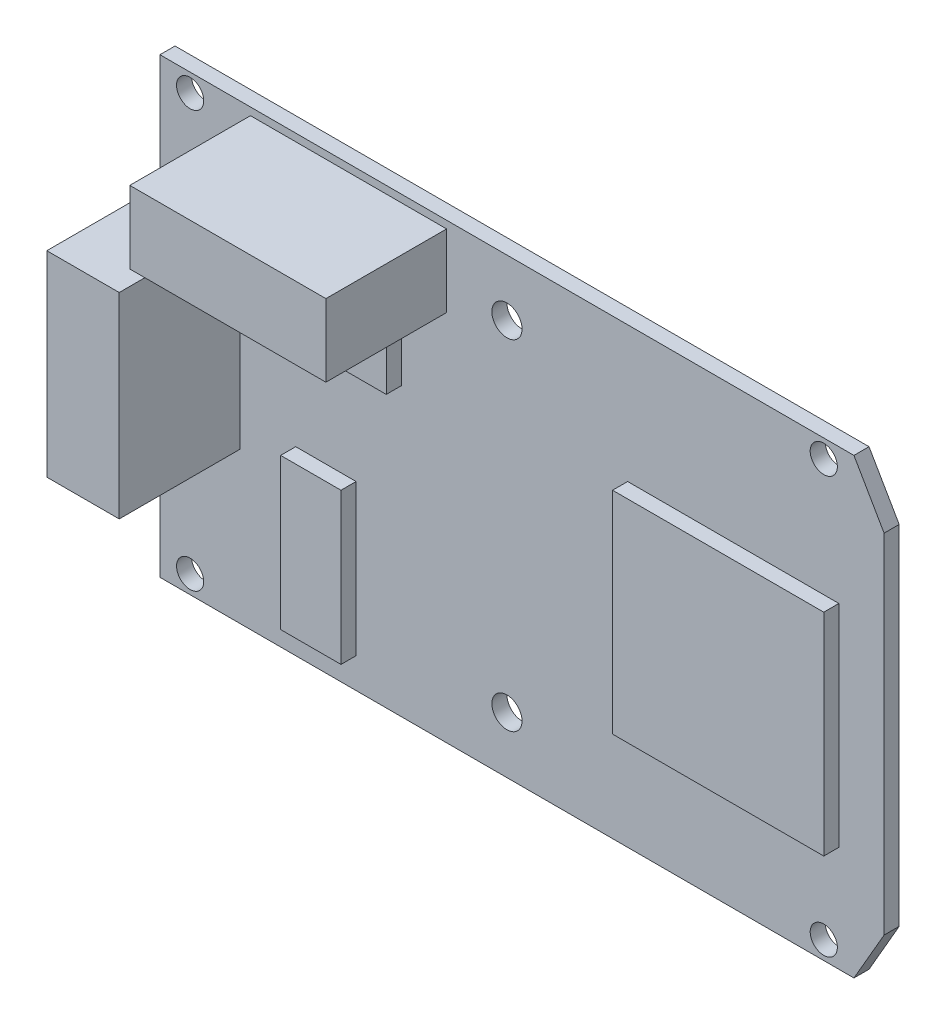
ISO-10303-21;
HEADER;
FILE_DESCRIPTION(('STEP AP214'),'2;1');
FILE_NAME('part.step','',(''),(''),'','','');
FILE_SCHEMA(('AUTOMOTIVE_DESIGN { 1 0 10303 214 1 1 1 1 }'));
ENDSEC;
DATA;
#1=APPLICATION_CONTEXT('core data for automotive mechanical design processes');
#2=APPLICATION_PROTOCOL_DEFINITION('international standard','automotive_design',2000,#1);
#3=PRODUCT_CONTEXT('',#1,'mechanical');
#4=PRODUCT('Part','Part','',(#3));
#5=PRODUCT_RELATED_PRODUCT_CATEGORY('part','',(#4));
#6=PRODUCT_DEFINITION_FORMATION('','',#4);
#7=PRODUCT_DEFINITION_CONTEXT('part definition',#1,'design');
#8=PRODUCT_DEFINITION('design','',#6,#7);
#9=PRODUCT_DEFINITION_SHAPE('','',#8);
#10=(LENGTH_UNIT() NAMED_UNIT(*) SI_UNIT(.MILLI.,.METRE.));
#11=(NAMED_UNIT(*) PLANE_ANGLE_UNIT() SI_UNIT($,.RADIAN.));
#12=(NAMED_UNIT(*) SI_UNIT($,.STERADIAN.) SOLID_ANGLE_UNIT());
#13=UNCERTAINTY_MEASURE_WITH_UNIT(LENGTH_MEASURE(1.E-05),#10,'distance_accuracy_value','');
#14=(GEOMETRIC_REPRESENTATION_CONTEXT(3) GLOBAL_UNCERTAINTY_ASSIGNED_CONTEXT((#13)) GLOBAL_UNIT_ASSIGNED_CONTEXT((#10,
#11,#12)) REPRESENTATION_CONTEXT('',''));
#15=CARTESIAN_POINT('',(0.,0.,0.));
#16=DIRECTION('',(0.,0.,1.));
#17=DIRECTION('',(1.,0.,0.));
#18=AXIS2_PLACEMENT_3D('',#15,#16,#17);
#19=CARTESIAN_POINT('',(-24.,-15.,0.));
#20=DIRECTION('',(0.,0.,1.));
#21=DIRECTION('',(1.,0.,0.));
#22=AXIS2_PLACEMENT_3D('',#19,#20,#21);
#23=PLANE('',#22);
#24=CARTESIAN_POINT('',(20.,-13.8,0.));
#25=DIRECTION('',(0.,0.,1.));
#26=DIRECTION('',(1.,0.,0.));
#27=AXIS2_PLACEMENT_3D('',#24,#25,#26);
#28=CIRCLE('',#27,0.9);
#29=CARTESIAN_POINT('',(20.9,-13.8,0.));
#30=VERTEX_POINT('',#29);
#31=EDGE_CURVE('E760',#30,#30,#28,.F.);
#32=ORIENTED_EDGE('',*,*,#31,.F.);
#33=EDGE_LOOP('',(#32));
#34=FACE_BOUND('',#33,.T.);
#35=CARTESIAN_POINT('',(20.,13.8,0.));
#36=DIRECTION('',(0.,0.,1.));
#37=DIRECTION('',(1.,0.,0.));
#38=AXIS2_PLACEMENT_3D('',#35,#36,#37);
#39=CIRCLE('',#38,0.9);
#40=CARTESIAN_POINT('',(20.9,13.8,0.));
#41=VERTEX_POINT('',#40);
#42=EDGE_CURVE('E764',#41,#41,#39,.F.);
#43=ORIENTED_EDGE('',*,*,#42,.F.);
#44=EDGE_LOOP('',(#43));
#45=FACE_BOUND('',#44,.T.);
#46=CARTESIAN_POINT('',(-22.,-13.8,0.));
#47=DIRECTION('',(0.,0.,1.));
#48=DIRECTION('',(1.,0.,0.));
#49=AXIS2_PLACEMENT_3D('',#46,#47,#48);
#50=CIRCLE('',#49,0.9);
#51=CARTESIAN_POINT('',(-21.1,-13.8,0.));
#52=VERTEX_POINT('',#51);
#53=EDGE_CURVE('E773',#52,#52,#50,.F.);
#54=ORIENTED_EDGE('',*,*,#53,.F.);
#55=EDGE_LOOP('',(#54));
#56=FACE_BOUND('',#55,.T.);
#57=CARTESIAN_POINT('',(-22.,13.8,0.));
#58=DIRECTION('',(0.,0.,1.));
#59=DIRECTION('',(1.,0.,0.));
#60=AXIS2_PLACEMENT_3D('',#57,#58,#59);
#61=CIRCLE('',#60,0.9);
#62=CARTESIAN_POINT('',(-21.1,13.8,0.));
#63=VERTEX_POINT('',#62);
#64=EDGE_CURVE('E779',#63,#63,#61,.F.);
#65=ORIENTED_EDGE('',*,*,#64,.F.);
#66=EDGE_LOOP('',(#65));
#67=FACE_BOUND('',#66,.T.);
#68=CARTESIAN_POINT('',(-1.,11.25,0.));
#69=DIRECTION('',(0.,0.,1.));
#70=DIRECTION('',(1.,0.,0.));
#71=AXIS2_PLACEMENT_3D('',#68,#69,#70);
#72=CIRCLE('',#71,1.);
#73=CARTESIAN_POINT('',(0.,11.25,0.));
#74=VERTEX_POINT('',#73);
#75=EDGE_CURVE('E785',#74,#74,#72,.F.);
#76=ORIENTED_EDGE('',*,*,#75,.F.);
#77=EDGE_LOOP('',(#76));
#78=FACE_BOUND('',#77,.T.);
#79=CARTESIAN_POINT('',(-0.999999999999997,-11.25,0.));
#80=DIRECTION('',(0.,0.,1.));
#81=DIRECTION('',(1.,0.,0.));
#82=AXIS2_PLACEMENT_3D('',#79,#80,#81);
#83=CIRCLE('',#82,1.);
#84=CARTESIAN_POINT('',(0.,-11.25,0.));
#85=VERTEX_POINT('',#84);
#86=EDGE_CURVE('E285',#85,#85,#83,.F.);
#87=ORIENTED_EDGE('',*,*,#86,.F.);
#88=EDGE_LOOP('',(#87));
#89=FACE_BOUND('',#88,.T.);
#90=DIRECTION('',(0.,-1.,0.));
#91=VECTOR('',#90,1.);
#92=CARTESIAN_POINT('',(-13.,7.,0.));
#93=LINE('',#92,#91);
#94=CARTESIAN_POINT('',(-13.,7.,0.));
#95=VERTEX_POINT('',#94);
#96=CARTESIAN_POINT('',(-13.,-3.,0.));
#97=VERTEX_POINT('',#96);
#98=EDGE_CURVE('E313',#95,#97,#93,.T.);
#99=ORIENTED_EDGE('',*,*,#98,.F.);
#100=DIRECTION('',(1.,0.,0.));
#101=VECTOR('',#100,1.);
#102=CARTESIAN_POINT('',(-13.,7.,0.));
#103=LINE('',#102,#101);
#104=CARTESIAN_POINT('',(-17.,7.,0.));
#105=VERTEX_POINT('',#104);
#106=EDGE_CURVE('E322',#105,#95,#103,.T.);
#107=ORIENTED_EDGE('',*,*,#106,.F.);
#108=DIRECTION('',(0.,1.,0.));
#109=VECTOR('',#108,1.);
#110=CARTESIAN_POINT('',(-17.,7.,0.));
#111=LINE('',#110,#109);
#112=CARTESIAN_POINT('',(-17.,-3.,0.));
#113=VERTEX_POINT('',#112);
#114=EDGE_CURVE('E319',#113,#105,#111,.T.);
#115=ORIENTED_EDGE('',*,*,#114,.F.);
#116=DIRECTION('',(-1.,0.,0.));
#117=VECTOR('',#116,1.);
#118=CARTESIAN_POINT('',(-13.,-3.,0.));
#119=LINE('',#118,#117);
#120=EDGE_CURVE('E316',#97,#113,#119,.T.);
#121=ORIENTED_EDGE('',*,*,#120,.F.);
#122=EDGE_LOOP('',(#99,#107,#115,#121));
#123=FACE_BOUND('',#122,.T.);
#124=DIRECTION('',(0.,1.,0.));
#125=VECTOR('',#124,1.);
#126=CARTESIAN_POINT('',(24.,15.,0.));
#127=LINE('',#126,#125);
#128=CARTESIAN_POINT('',(24.,-11.5358983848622,0.));
#129=VERTEX_POINT('',#128);
#130=CARTESIAN_POINT('',(24.,11.5358983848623,0.));
#131=VERTEX_POINT('',#130);
#132=EDGE_CURVE('E529',#129,#131,#127,.T.);
#133=ORIENTED_EDGE('',*,*,#132,.F.);
#134=DIRECTION('',(0.5,0.866025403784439,0.));
#135=VECTOR('',#134,1.);
#136=CARTESIAN_POINT('',(24.,-11.5358983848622,0.));
#137=LINE('',#136,#135);
#138=CARTESIAN_POINT('',(22.,-15.,0.));
#139=VERTEX_POINT('',#138);
#140=EDGE_CURVE('E55',#129,#139,#137,.F.);
#141=ORIENTED_EDGE('',*,*,#140,.T.);
#142=DIRECTION('',(1.,0.,0.));
#143=VECTOR('',#142,1.);
#144=CARTESIAN_POINT('',(-24.,-15.,0.));
#145=LINE('',#144,#143);
#146=CARTESIAN_POINT('',(-24.,-15.,0.));
#147=VERTEX_POINT('',#146);
#148=EDGE_CURVE('E527',#147,#139,#145,.T.);
#149=ORIENTED_EDGE('',*,*,#148,.F.);
#150=DIRECTION('',(0.,-1.,0.));
#151=VECTOR('',#150,1.);
#152=CARTESIAN_POINT('',(-24.,15.,0.));
#153=LINE('',#152,#151);
#154=CARTESIAN_POINT('',(-24.,15.,0.));
#155=VERTEX_POINT('',#154);
#156=EDGE_CURVE('E524',#155,#147,#153,.T.);
#157=ORIENTED_EDGE('',*,*,#156,.F.);
#158=DIRECTION('',(-1.,0.,0.));
#159=VECTOR('',#158,1.);
#160=CARTESIAN_POINT('',(-24.,15.,0.));
#161=LINE('',#160,#159);
#162=CARTESIAN_POINT('',(22.,15.,0.));
#163=VERTEX_POINT('',#162);
#164=EDGE_CURVE('E531',#163,#155,#161,.T.);
#165=ORIENTED_EDGE('',*,*,#164,.F.);
#166=DIRECTION('',(-0.500000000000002,0.866025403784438,0.));
#167=VECTOR('',#166,1.);
#168=CARTESIAN_POINT('',(22.,15.,0.));
#169=LINE('',#168,#167);
#170=EDGE_CURVE('E551',#163,#131,#169,.F.);
#171=ORIENTED_EDGE('',*,*,#170,.T.);
#172=EDGE_LOOP('',(#133,#141,#149,#157,#165,#171));
#173=FACE_BOUND('',#172,.T.);
#174=DIRECTION('',(0.,-1.,0.));
#175=VECTOR('',#174,1.);
#176=CARTESIAN_POINT('',(14.5,-10.,0.));
#177=LINE('',#176,#175);
#178=CARTESIAN_POINT('',(14.5,-10.,0.));
#179=VERTEX_POINT('',#178);
#180=CARTESIAN_POINT('',(14.5,-14.8,0.));
#181=VERTEX_POINT('',#180);
#182=EDGE_CURVE('E346',#179,#181,#177,.T.);
#183=ORIENTED_EDGE('',*,*,#182,.F.);
#184=DIRECTION('',(1.,0.,0.));
#185=VECTOR('',#184,1.);
#186=CARTESIAN_POINT('',(14.5,-10.,0.));
#187=LINE('',#186,#185);
#188=CARTESIAN_POINT('',(1.50000000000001,-10.,0.));
#189=VERTEX_POINT('',#188);
#190=EDGE_CURVE('E355',#189,#179,#187,.T.);
#191=ORIENTED_EDGE('',*,*,#190,.F.);
#192=DIRECTION('',(0.,1.,0.));
#193=VECTOR('',#192,1.);
#194=CARTESIAN_POINT('',(1.50000000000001,-10.,0.));
#195=LINE('',#194,#193);
#196=CARTESIAN_POINT('',(1.50000000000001,-14.8,0.));
#197=VERTEX_POINT('',#196);
#198=EDGE_CURVE('E352',#197,#189,#195,.T.);
#199=ORIENTED_EDGE('',*,*,#198,.F.);
#200=DIRECTION('',(-1.,0.,0.));
#201=VECTOR('',#200,1.);
#202=CARTESIAN_POINT('',(14.5,-14.8,0.));
#203=LINE('',#202,#201);
#204=EDGE_CURVE('E349',#181,#197,#203,.T.);
#205=ORIENTED_EDGE('',*,*,#204,.F.);
#206=EDGE_LOOP('',(#183,#191,#199,#205));
#207=FACE_BOUND('',#206,.T.);
#208=DIRECTION('',(0.,-1.,0.));
#209=VECTOR('',#208,1.);
#210=CARTESIAN_POINT('',(5.,5.,0.));
#211=LINE('',#210,#209);
#212=CARTESIAN_POINT('',(5.,5.,0.));
#213=VERTEX_POINT('',#212);
#214=CARTESIAN_POINT('',(5.,-6.,0.));
#215=VERTEX_POINT('',#214);
#216=EDGE_CURVE('E275',#213,#215,#211,.T.);
#217=ORIENTED_EDGE('',*,*,#216,.F.);
#218=DIRECTION('',(1.,0.,0.));
#219=VECTOR('',#218,1.);
#220=CARTESIAN_POINT('',(5.,5.,0.));
#221=LINE('',#220,#219);
#222=CARTESIAN_POINT('',(-6.,5.,0.));
#223=VERTEX_POINT('',#222);
#224=EDGE_CURVE('E277',#223,#213,#221,.T.);
#225=ORIENTED_EDGE('',*,*,#224,.F.);
#226=DIRECTION('',(0.,1.,0.));
#227=VECTOR('',#226,1.);
#228=CARTESIAN_POINT('',(-6.,5.,0.));
#229=LINE('',#228,#227);
#230=CARTESIAN_POINT('',(-6.,-6.,0.));
#231=VERTEX_POINT('',#230);
#232=EDGE_CURVE('E297',#231,#223,#229,.T.);
#233=ORIENTED_EDGE('',*,*,#232,.F.);
#234=DIRECTION('',(-1.,0.,0.));
#235=VECTOR('',#234,1.);
#236=CARTESIAN_POINT('',(5.,-6.,0.));
#237=LINE('',#236,#235);
#238=EDGE_CURVE('E280',#215,#231,#237,.T.);
#239=ORIENTED_EDGE('',*,*,#238,.F.);
#240=EDGE_LOOP('',(#217,#225,#233,#239));
#241=FACE_BOUND('',#240,.T.);
#242=ADVANCED_FACE('F33',(#34,#45,#56,#67,#78,#89,#123,#173,#207,#241),#23,.F.);
#243=CARTESIAN_POINT('',(-24.,-15.,1.));
#244=DIRECTION('',(0.,0.,1.));
#245=DIRECTION('',(1.,0.,0.));
#246=AXIS2_PLACEMENT_3D('',#243,#244,#245);
#247=PLANE('',#246);
#248=CARTESIAN_POINT('',(20.,-13.8,1.));
#249=DIRECTION('',(0.,0.,1.));
#250=DIRECTION('',(1.,0.,0.));
#251=AXIS2_PLACEMENT_3D('',#248,#249,#250);
#252=CIRCLE('',#251,0.9);
#253=CARTESIAN_POINT('',(20.9,-13.8,1.));
#254=VERTEX_POINT('',#253);
#255=EDGE_CURVE('E758',#254,#254,#252,.T.);
#256=ORIENTED_EDGE('',*,*,#255,.F.);
#257=EDGE_LOOP('',(#256));
#258=FACE_BOUND('',#257,.T.);
#259=CARTESIAN_POINT('',(20.,13.8,1.));
#260=DIRECTION('',(0.,0.,1.));
#261=DIRECTION('',(1.,0.,0.));
#262=AXIS2_PLACEMENT_3D('',#259,#260,#261);
#263=CIRCLE('',#262,0.9);
#264=CARTESIAN_POINT('',(20.9,13.8,1.));
#265=VERTEX_POINT('',#264);
#266=EDGE_CURVE('E761',#265,#265,#263,.T.);
#267=ORIENTED_EDGE('',*,*,#266,.F.);
#268=EDGE_LOOP('',(#267));
#269=FACE_BOUND('',#268,.T.);
#270=CARTESIAN_POINT('',(-22.,-13.8,1.));
#271=DIRECTION('',(0.,0.,1.));
#272=DIRECTION('',(1.,0.,0.));
#273=AXIS2_PLACEMENT_3D('',#270,#271,#272);
#274=CIRCLE('',#273,0.9);
#275=CARTESIAN_POINT('',(-21.1,-13.8,1.));
#276=VERTEX_POINT('',#275);
#277=EDGE_CURVE('E770',#276,#276,#274,.T.);
#278=ORIENTED_EDGE('',*,*,#277,.F.);
#279=EDGE_LOOP('',(#278));
#280=FACE_BOUND('',#279,.T.);
#281=CARTESIAN_POINT('',(-22.,13.8,1.));
#282=DIRECTION('',(0.,0.,1.));
#283=DIRECTION('',(1.,0.,0.));
#284=AXIS2_PLACEMENT_3D('',#281,#282,#283);
#285=CIRCLE('',#284,0.9);
#286=CARTESIAN_POINT('',(-21.1,13.8,1.));
#287=VERTEX_POINT('',#286);
#288=EDGE_CURVE('E776',#287,#287,#285,.T.);
#289=ORIENTED_EDGE('',*,*,#288,.F.);
#290=EDGE_LOOP('',(#289));
#291=FACE_BOUND('',#290,.T.);
#292=CARTESIAN_POINT('',(-1.,11.25,1.));
#293=DIRECTION('',(0.,0.,1.));
#294=DIRECTION('',(-1.,0.,0.));
#295=AXIS2_PLACEMENT_3D('',#292,#293,#294);
#296=CIRCLE('',#295,1.);
#297=CARTESIAN_POINT('',(-2.,11.25,1.));
#298=VERTEX_POINT('',#297);
#299=EDGE_CURVE('E782',#298,#298,#296,.T.);
#300=ORIENTED_EDGE('',*,*,#299,.F.);
#301=EDGE_LOOP('',(#300));
#302=FACE_BOUND('',#301,.T.);
#303=CARTESIAN_POINT('',(-0.999999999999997,-11.25,1.));
#304=DIRECTION('',(0.,0.,1.));
#305=DIRECTION('',(1.,0.,0.));
#306=AXIS2_PLACEMENT_3D('',#303,#304,#305);
#307=CIRCLE('',#306,1.);
#308=CARTESIAN_POINT('',(0.,-11.25,1.));
#309=VERTEX_POINT('',#308);
#310=EDGE_CURVE('E788',#309,#309,#307,.T.);
#311=ORIENTED_EDGE('',*,*,#310,.F.);
#312=EDGE_LOOP('',(#311));
#313=FACE_BOUND('',#312,.T.);
#314=DIRECTION('',(1.,0.,0.));
#315=VECTOR('',#314,1.);
#316=CARTESIAN_POINT('',(-23.5,-5.,1.));
#317=LINE('',#316,#315);
#318=CARTESIAN_POINT('',(-23.5,-5.,1.));
#319=VERTEX_POINT('',#318);
#320=CARTESIAN_POINT('',(-18.7,-5.,1.));
#321=VERTEX_POINT('',#320);
#322=EDGE_CURVE('E411',#319,#321,#317,.T.);
#323=ORIENTED_EDGE('',*,*,#322,.F.);
#324=DIRECTION('',(0.,-1.,0.));
#325=VECTOR('',#324,1.);
#326=CARTESIAN_POINT('',(-23.5,8.,1.));
#327=LINE('',#326,#325);
#328=CARTESIAN_POINT('',(-23.5,8.,1.));
#329=VERTEX_POINT('',#328);
#330=EDGE_CURVE('E408',#329,#319,#327,.T.);
#331=ORIENTED_EDGE('',*,*,#330,.F.);
#332=DIRECTION('',(-1.,0.,0.));
#333=VECTOR('',#332,1.);
#334=CARTESIAN_POINT('',(-23.5,8.,1.));
#335=LINE('',#334,#333);
#336=CARTESIAN_POINT('',(-18.7,8.,1.));
#337=VERTEX_POINT('',#336);
#338=EDGE_CURVE('E416',#337,#329,#335,.T.);
#339=ORIENTED_EDGE('',*,*,#338,.F.);
#340=DIRECTION('',(0.,1.,0.));
#341=VECTOR('',#340,1.);
#342=CARTESIAN_POINT('',(-18.7,8.,1.));
#343=LINE('',#342,#341);
#344=EDGE_CURVE('E413',#321,#337,#343,.T.);
#345=ORIENTED_EDGE('',*,*,#344,.F.);
#346=EDGE_LOOP('',(#323,#331,#339,#345));
#347=FACE_BOUND('',#346,.T.);
#348=DIRECTION('',(1.,0.,0.));
#349=VECTOR('',#348,1.);
#350=CARTESIAN_POINT('',(-15.,-13.,1.));
#351=LINE('',#350,#349);
#352=CARTESIAN_POINT('',(-15.,-13.,1.));
#353=VERTEX_POINT('',#352);
#354=CARTESIAN_POINT('',(-11.,-13.,1.));
#355=VERTEX_POINT('',#354);
#356=EDGE_CURVE('E469',#353,#355,#351,.T.);
#357=ORIENTED_EDGE('',*,*,#356,.F.);
#358=DIRECTION('',(0.,-1.,0.));
#359=VECTOR('',#358,1.);
#360=CARTESIAN_POINT('',(-15.,-3.,1.));
#361=LINE('',#360,#359);
#362=CARTESIAN_POINT('',(-15.,-3.,1.));
#363=VERTEX_POINT('',#362);
#364=EDGE_CURVE('E466',#363,#353,#361,.T.);
#365=ORIENTED_EDGE('',*,*,#364,.F.);
#366=DIRECTION('',(-1.,0.,0.));
#367=VECTOR('',#366,1.);
#368=CARTESIAN_POINT('',(-15.,-3.,1.));
#369=LINE('',#368,#367);
#370=CARTESIAN_POINT('',(-11.,-3.,1.));
#371=VERTEX_POINT('',#370);
#372=EDGE_CURVE('E474',#371,#363,#369,.T.);
#373=ORIENTED_EDGE('',*,*,#372,.F.);
#374=DIRECTION('',(0.,1.,0.));
#375=VECTOR('',#374,1.);
#376=CARTESIAN_POINT('',(-11.,-3.,1.));
#377=LINE('',#376,#375);
#378=EDGE_CURVE('E471',#355,#371,#377,.T.);
#379=ORIENTED_EDGE('',*,*,#378,.F.);
#380=EDGE_LOOP('',(#357,#365,#373,#379));
#381=FACE_BOUND('',#380,.T.);
#382=DIRECTION('',(1.,0.,0.));
#383=VECTOR('',#382,1.);
#384=CARTESIAN_POINT('',(-24.,-15.,1.));
#385=LINE('',#384,#383);
#386=CARTESIAN_POINT('',(-24.,-15.,1.));
#387=VERTEX_POINT('',#386);
#388=CARTESIAN_POINT('',(22.,-15.,1.));
#389=VERTEX_POINT('',#388);
#390=EDGE_CURVE('E536',#387,#389,#385,.T.);
#391=ORIENTED_EDGE('',*,*,#390,.T.);
#392=DIRECTION('',(-0.5,-0.866025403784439,0.));
#393=VECTOR('',#392,1.);
#394=CARTESIAN_POINT('',(10.5,-34.9185842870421,1.));
#395=LINE('',#394,#393);
#396=CARTESIAN_POINT('',(24.,-11.5358983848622,1.));
#397=VERTEX_POINT('',#396);
#398=EDGE_CURVE('E11',#389,#397,#395,.F.);
#399=ORIENTED_EDGE('',*,*,#398,.T.);
#400=DIRECTION('',(0.,1.,0.));
#401=VECTOR('',#400,1.);
#402=CARTESIAN_POINT('',(24.,15.,1.));
#403=LINE('',#402,#401);
#404=CARTESIAN_POINT('',(24.,11.5358983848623,1.));
#405=VERTEX_POINT('',#404);
#406=EDGE_CURVE('E538',#397,#405,#403,.T.);
#407=ORIENTED_EDGE('',*,*,#406,.T.);
#408=DIRECTION('',(0.500000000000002,-0.866025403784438,0.));
#409=VECTOR('',#408,1.);
#410=CARTESIAN_POINT('',(23.4903810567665,12.4185842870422,1.));
#411=LINE('',#410,#409);
#412=CARTESIAN_POINT('',(22.,15.,1.));
#413=VERTEX_POINT('',#412);
#414=EDGE_CURVE('E557',#405,#413,#411,.F.);
#415=ORIENTED_EDGE('',*,*,#414,.T.);
#416=DIRECTION('',(-1.,0.,0.));
#417=VECTOR('',#416,1.);
#418=CARTESIAN_POINT('',(-24.,15.,1.));
#419=LINE('',#418,#417);
#420=CARTESIAN_POINT('',(-24.,15.,1.));
#421=VERTEX_POINT('',#420);
#422=EDGE_CURVE('E540',#413,#421,#419,.T.);
#423=ORIENTED_EDGE('',*,*,#422,.T.);
#424=DIRECTION('',(0.,-1.,0.));
#425=VECTOR('',#424,1.);
#426=CARTESIAN_POINT('',(-24.,15.,1.));
#427=LINE('',#426,#425);
#428=EDGE_CURVE('E533',#421,#387,#427,.T.);
#429=ORIENTED_EDGE('',*,*,#428,.T.);
#430=EDGE_LOOP('',(#391,#399,#407,#415,#423,#429));
#431=FACE_BOUND('',#430,.T.);
#432=DIRECTION('',(1.,0.,0.));
#433=VECTOR('',#432,1.);
#434=CARTESIAN_POINT('',(7.00000000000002,-8.,1.));
#435=LINE('',#434,#433);
#436=CARTESIAN_POINT('',(7.00000000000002,-8.,1.));
#437=VERTEX_POINT('',#436);
#438=CARTESIAN_POINT('',(21.,-8.,1.));
#439=VERTEX_POINT('',#438);
#440=EDGE_CURVE('E498',#437,#439,#435,.T.);
#441=ORIENTED_EDGE('',*,*,#440,.F.);
#442=DIRECTION('',(0.,-1.,0.));
#443=VECTOR('',#442,1.);
#444=CARTESIAN_POINT('',(7.00000000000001,6.,1.));
#445=LINE('',#444,#443);
#446=CARTESIAN_POINT('',(7.00000000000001,6.,1.));
#447=VERTEX_POINT('',#446);
#448=EDGE_CURVE('E495',#447,#437,#445,.T.);
#449=ORIENTED_EDGE('',*,*,#448,.F.);
#450=DIRECTION('',(-1.,0.,0.));
#451=VECTOR('',#450,1.);
#452=CARTESIAN_POINT('',(7.00000000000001,6.,1.));
#453=LINE('',#452,#451);
#454=CARTESIAN_POINT('',(21.,6.,1.));
#455=VERTEX_POINT('',#454);
#456=EDGE_CURVE('E503',#455,#447,#453,.T.);
#457=ORIENTED_EDGE('',*,*,#456,.F.);
#458=DIRECTION('',(0.,1.,0.));
#459=VECTOR('',#458,1.);
#460=CARTESIAN_POINT('',(21.,6.,1.));
#461=LINE('',#460,#459);
#462=EDGE_CURVE('E500',#439,#455,#461,.T.);
#463=ORIENTED_EDGE('',*,*,#462,.F.);
#464=EDGE_LOOP('',(#441,#449,#457,#463));
#465=FACE_BOUND('',#464,.T.);
#466=DIRECTION('',(1.,0.,0.));
#467=VECTOR('',#466,1.);
#468=CARTESIAN_POINT('',(-18.,4.,1.));
#469=LINE('',#468,#467);
#470=CARTESIAN_POINT('',(-18.,4.,1.));
#471=VERTEX_POINT('',#470);
#472=CARTESIAN_POINT('',(-7.99999999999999,4.,1.));
#473=VERTEX_POINT('',#472);
#474=EDGE_CURVE('E440',#471,#473,#469,.T.);
#475=ORIENTED_EDGE('',*,*,#474,.F.);
#476=DIRECTION('',(0.,-1.,0.));
#477=VECTOR('',#476,1.);
#478=CARTESIAN_POINT('',(-18.,8.,1.));
#479=LINE('',#478,#477);
#480=CARTESIAN_POINT('',(-18.,8.,1.));
#481=VERTEX_POINT('',#480);
#482=EDGE_CURVE('E437',#481,#471,#479,.T.);
#483=ORIENTED_EDGE('',*,*,#482,.F.);
#484=DIRECTION('',(-1.,0.,0.));
#485=VECTOR('',#484,1.);
#486=CARTESIAN_POINT('',(-18.,8.,1.));
#487=LINE('',#486,#485);
#488=CARTESIAN_POINT('',(-7.99999999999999,8.,1.));
#489=VERTEX_POINT('',#488);
#490=EDGE_CURVE('E445',#489,#481,#487,.T.);
#491=ORIENTED_EDGE('',*,*,#490,.F.);
#492=DIRECTION('',(0.,1.,0.));
#493=VECTOR('',#492,1.);
#494=CARTESIAN_POINT('',(-7.99999999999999,8.,1.));
#495=LINE('',#494,#493);
#496=EDGE_CURVE('E442',#473,#489,#495,.T.);
#497=ORIENTED_EDGE('',*,*,#496,.F.);
#498=EDGE_LOOP('',(#475,#483,#491,#497));
#499=FACE_BOUND('',#498,.T.);
#500=DIRECTION('',(1.,0.,0.));
#501=VECTOR('',#500,1.);
#502=CARTESIAN_POINT('',(-18.,9.7,1.));
#503=LINE('',#502,#501);
#504=CARTESIAN_POINT('',(-18.,9.7,1.));
#505=VERTEX_POINT('',#504);
#506=CARTESIAN_POINT('',(-4.99999999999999,9.7,1.));
#507=VERTEX_POINT('',#506);
#508=EDGE_CURVE('E382',#505,#507,#503,.T.);
#509=ORIENTED_EDGE('',*,*,#508,.F.);
#510=DIRECTION('',(0.,-1.,0.));
#511=VECTOR('',#510,1.);
#512=CARTESIAN_POINT('',(-18.,14.5,1.));
#513=LINE('',#512,#511);
#514=CARTESIAN_POINT('',(-18.,14.5,1.));
#515=VERTEX_POINT('',#514);
#516=EDGE_CURVE('E379',#515,#505,#513,.T.);
#517=ORIENTED_EDGE('',*,*,#516,.F.);
#518=DIRECTION('',(-1.,0.,0.));
#519=VECTOR('',#518,1.);
#520=CARTESIAN_POINT('',(-18.,14.5,1.));
#521=LINE('',#520,#519);
#522=CARTESIAN_POINT('',(-4.99999999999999,14.5,1.));
#523=VERTEX_POINT('',#522);
#524=EDGE_CURVE('E387',#523,#515,#521,.T.);
#525=ORIENTED_EDGE('',*,*,#524,.F.);
#526=DIRECTION('',(0.,1.,0.));
#527=VECTOR('',#526,1.);
#528=CARTESIAN_POINT('',(-4.99999999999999,14.5,1.));
#529=LINE('',#528,#527);
#530=EDGE_CURVE('E384',#507,#523,#529,.T.);
#531=ORIENTED_EDGE('',*,*,#530,.F.);
#532=EDGE_LOOP('',(#509,#517,#525,#531));
#533=FACE_BOUND('',#532,.T.);
#534=ADVANCED_FACE('F578',(#258,#269,#280,#291,#302,#313,#347,#381,#431,#465,#499,#533),#247,.T.);
#535=CARTESIAN_POINT('',(-24.,15.,1.));
#536=DIRECTION('',(1.,0.,0.));
#537=DIRECTION('',(0.,1.,0.));
#538=AXIS2_PLACEMENT_3D('',#535,#536,#537);
#539=PLANE('',#538);
#540=ORIENTED_EDGE('',*,*,#156,.T.);
#541=DIRECTION('',(0.,0.,-1.));
#542=VECTOR('',#541,1.);
#543=CARTESIAN_POINT('',(-24.,-15.,1.));
#544=LINE('',#543,#542);
#545=EDGE_CURVE('E545',#387,#147,#544,.T.);
#546=ORIENTED_EDGE('',*,*,#545,.F.);
#547=ORIENTED_EDGE('',*,*,#428,.F.);
#548=DIRECTION('',(0.,0.,-1.));
#549=VECTOR('',#548,1.);
#550=CARTESIAN_POINT('',(-24.,15.,1.));
#551=LINE('',#550,#549);
#552=EDGE_CURVE('E542',#421,#155,#551,.T.);
#553=ORIENTED_EDGE('',*,*,#552,.T.);
#554=EDGE_LOOP('',(#540,#546,#547,#553));
#555=FACE_BOUND('',#554,.T.);
#556=ADVANCED_FACE('F35',(#555),#539,.F.);
#557=CARTESIAN_POINT('',(-24.,-15.,1.));
#558=DIRECTION('',(0.,1.,0.));
#559=DIRECTION('',(0.,0.,1.));
#560=AXIS2_PLACEMENT_3D('',#557,#558,#559);
#561=PLANE('',#560);
#562=ORIENTED_EDGE('',*,*,#148,.T.);
#563=DIRECTION('',(0.,0.,1.));
#564=VECTOR('',#563,1.);
#565=CARTESIAN_POINT('',(22.,-15.,1.));
#566=LINE('',#565,#564);
#567=EDGE_CURVE('E41',#139,#389,#566,.T.);
#568=ORIENTED_EDGE('',*,*,#567,.T.);
#569=ORIENTED_EDGE('',*,*,#390,.F.);
#570=ORIENTED_EDGE('',*,*,#545,.T.);
#571=EDGE_LOOP('',(#562,#568,#569,#570));
#572=FACE_BOUND('',#571,.T.);
#573=ADVANCED_FACE('F616',(#572),#561,.F.);
#574=CARTESIAN_POINT('',(24.,15.,1.));
#575=DIRECTION('',(-1.,0.,0.));
#576=DIRECTION('',(0.,-1.,0.));
#577=AXIS2_PLACEMENT_3D('',#574,#575,#576);
#578=PLANE('',#577);
#579=ORIENTED_EDGE('',*,*,#406,.F.);
#580=DIRECTION('',(0.,0.,-1.));
#581=VECTOR('',#580,1.);
#582=CARTESIAN_POINT('',(24.,-11.5358983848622,1.));
#583=LINE('',#582,#581);
#584=EDGE_CURVE('E559',#397,#129,#583,.T.);
#585=ORIENTED_EDGE('',*,*,#584,.T.);
#586=ORIENTED_EDGE('',*,*,#132,.T.);
#587=DIRECTION('',(0.,0.,1.));
#588=VECTOR('',#587,1.);
#589=CARTESIAN_POINT('',(24.,11.5358983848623,1.));
#590=LINE('',#589,#588);
#591=EDGE_CURVE('E554',#131,#405,#590,.T.);
#592=ORIENTED_EDGE('',*,*,#591,.T.);
#593=EDGE_LOOP('',(#579,#585,#586,#592));
#594=FACE_BOUND('',#593,.T.);
#595=ADVANCED_FACE('F565',(#594),#578,.F.);
#596=CARTESIAN_POINT('',(-24.,15.,1.));
#597=DIRECTION('',(0.,-1.,0.));
#598=DIRECTION('',(0.,0.,-1.));
#599=AXIS2_PLACEMENT_3D('',#596,#597,#598);
#600=PLANE('',#599);
#601=ORIENTED_EDGE('',*,*,#422,.F.);
#602=DIRECTION('',(0.,0.,-1.));
#603=VECTOR('',#602,1.);
#604=CARTESIAN_POINT('',(22.,15.,1.));
#605=LINE('',#604,#603);
#606=EDGE_CURVE('E548',#413,#163,#605,.T.);
#607=ORIENTED_EDGE('',*,*,#606,.T.);
#608=ORIENTED_EDGE('',*,*,#164,.T.);
#609=ORIENTED_EDGE('',*,*,#552,.F.);
#610=EDGE_LOOP('',(#601,#607,#608,#609));
#611=FACE_BOUND('',#610,.T.);
#612=ADVANCED_FACE('F582',(#611),#600,.F.);
#613=CARTESIAN_POINT('',(7.00000000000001,6.,2.));
#614=DIRECTION('',(1.,0.,0.));
#615=DIRECTION('',(0.,1.,0.));
#616=AXIS2_PLACEMENT_3D('',#613,#614,#615);
#617=PLANE('',#616);
#618=ORIENTED_EDGE('',*,*,#448,.T.);
#619=DIRECTION('',(0.,0.,-1.));
#620=VECTOR('',#619,1.);
#621=CARTESIAN_POINT('',(7.00000000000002,-8.,2.));
#622=LINE('',#621,#620);
#623=CARTESIAN_POINT('',(7.00000000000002,-8.,2.));
#624=VERTEX_POINT('',#623);
#625=EDGE_CURVE('E522',#624,#437,#622,.T.);
#626=ORIENTED_EDGE('',*,*,#625,.F.);
#627=DIRECTION('',(0.,-1.,0.));
#628=VECTOR('',#627,1.);
#629=CARTESIAN_POINT('',(7.00000000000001,6.,2.));
#630=LINE('',#629,#628);
#631=CARTESIAN_POINT('',(7.00000000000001,6.,2.));
#632=VERTEX_POINT('',#631);
#633=EDGE_CURVE('E505',#632,#624,#630,.T.);
#634=ORIENTED_EDGE('',*,*,#633,.F.);
#635=DIRECTION('',(0.,0.,-1.));
#636=VECTOR('',#635,1.);
#637=CARTESIAN_POINT('',(7.00000000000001,6.,2.));
#638=LINE('',#637,#636);
#639=EDGE_CURVE('E514',#632,#447,#638,.T.);
#640=ORIENTED_EDGE('',*,*,#639,.T.);
#641=EDGE_LOOP('',(#618,#626,#634,#640));
#642=FACE_BOUND('',#641,.T.);
#643=ADVANCED_FACE('F610',(#642),#617,.F.);
#644=CARTESIAN_POINT('',(7.00000000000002,-8.,2.));
#645=DIRECTION('',(0.,1.,0.));
#646=DIRECTION('',(0.,0.,1.));
#647=AXIS2_PLACEMENT_3D('',#644,#645,#646);
#648=PLANE('',#647);
#649=ORIENTED_EDGE('',*,*,#440,.T.);
#650=DIRECTION('',(0.,0.,-1.));
#651=VECTOR('',#650,1.);
#652=CARTESIAN_POINT('',(21.,-8.,2.));
#653=LINE('',#652,#651);
#654=CARTESIAN_POINT('',(21.,-8.,2.));
#655=VERTEX_POINT('',#654);
#656=EDGE_CURVE('E519',#655,#439,#653,.T.);
#657=ORIENTED_EDGE('',*,*,#656,.F.);
#658=DIRECTION('',(1.,0.,0.));
#659=VECTOR('',#658,1.);
#660=CARTESIAN_POINT('',(7.00000000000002,-8.,2.));
#661=LINE('',#660,#659);
#662=EDGE_CURVE('E508',#624,#655,#661,.T.);
#663=ORIENTED_EDGE('',*,*,#662,.F.);
#664=ORIENTED_EDGE('',*,*,#625,.T.);
#665=EDGE_LOOP('',(#649,#657,#663,#664));
#666=FACE_BOUND('',#665,.T.);
#667=ADVANCED_FACE('F929',(#666),#648,.F.);
#668=CARTESIAN_POINT('',(21.,6.,2.));
#669=DIRECTION('',(-1.,0.,0.));
#670=DIRECTION('',(0.,-1.,0.));
#671=AXIS2_PLACEMENT_3D('',#668,#669,#670);
#672=PLANE('',#671);
#673=ORIENTED_EDGE('',*,*,#462,.T.);
#674=DIRECTION('',(0.,0.,-1.));
#675=VECTOR('',#674,1.);
#676=CARTESIAN_POINT('',(21.,6.,2.));
#677=LINE('',#676,#675);
#678=CARTESIAN_POINT('',(21.,6.,2.));
#679=VERTEX_POINT('',#678);
#680=EDGE_CURVE('E517',#679,#455,#677,.T.);
#681=ORIENTED_EDGE('',*,*,#680,.F.);
#682=DIRECTION('',(0.,1.,0.));
#683=VECTOR('',#682,1.);
#684=CARTESIAN_POINT('',(21.,6.,2.));
#685=LINE('',#684,#683);
#686=EDGE_CURVE('E510',#655,#679,#685,.T.);
#687=ORIENTED_EDGE('',*,*,#686,.F.);
#688=ORIENTED_EDGE('',*,*,#656,.T.);
#689=EDGE_LOOP('',(#673,#681,#687,#688));
#690=FACE_BOUND('',#689,.T.);
#691=ADVANCED_FACE('F926',(#690),#672,.F.);
#692=CARTESIAN_POINT('',(7.00000000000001,6.,2.));
#693=DIRECTION('',(0.,-1.,0.));
#694=DIRECTION('',(0.,0.,-1.));
#695=AXIS2_PLACEMENT_3D('',#692,#693,#694);
#696=PLANE('',#695);
#697=ORIENTED_EDGE('',*,*,#456,.T.);
#698=ORIENTED_EDGE('',*,*,#639,.F.);
#699=DIRECTION('',(-1.,0.,0.));
#700=VECTOR('',#699,1.);
#701=CARTESIAN_POINT('',(7.00000000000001,6.,2.));
#702=LINE('',#701,#700);
#703=EDGE_CURVE('E512',#679,#632,#702,.T.);
#704=ORIENTED_EDGE('',*,*,#703,.F.);
#705=ORIENTED_EDGE('',*,*,#680,.T.);
#706=EDGE_LOOP('',(#697,#698,#704,#705));
#707=FACE_BOUND('',#706,.T.);
#708=ADVANCED_FACE('F922',(#707),#696,.F.);
#709=CARTESIAN_POINT('',(7.00000000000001,6.,2.));
#710=DIRECTION('',(0.,0.,1.));
#711=DIRECTION('',(1.,0.,0.));
#712=AXIS2_PLACEMENT_3D('',#709,#710,#711);
#713=PLANE('',#712);
#714=ORIENTED_EDGE('',*,*,#633,.T.);
#715=ORIENTED_EDGE('',*,*,#662,.T.);
#716=ORIENTED_EDGE('',*,*,#686,.T.);
#717=ORIENTED_EDGE('',*,*,#703,.T.);
#718=EDGE_LOOP('',(#714,#715,#716,#717));
#719=FACE_BOUND('',#718,.T.);
#720=ADVANCED_FACE('F918',(#719),#713,.T.);
#721=CARTESIAN_POINT('',(-15.,-3.,2.));
#722=DIRECTION('',(1.,0.,0.));
#723=DIRECTION('',(0.,1.,0.));
#724=AXIS2_PLACEMENT_3D('',#721,#722,#723);
#725=PLANE('',#724);
#726=ORIENTED_EDGE('',*,*,#364,.T.);
#727=DIRECTION('',(0.,0.,-1.));
#728=VECTOR('',#727,1.);
#729=CARTESIAN_POINT('',(-15.,-13.,2.));
#730=LINE('',#729,#728);
#731=CARTESIAN_POINT('',(-15.,-13.,2.));
#732=VERTEX_POINT('',#731);
#733=EDGE_CURVE('E493',#732,#353,#730,.T.);
#734=ORIENTED_EDGE('',*,*,#733,.F.);
#735=DIRECTION('',(0.,-1.,0.));
#736=VECTOR('',#735,1.);
#737=CARTESIAN_POINT('',(-15.,-3.,2.));
#738=LINE('',#737,#736);
#739=CARTESIAN_POINT('',(-15.,-3.,2.));
#740=VERTEX_POINT('',#739);
#741=EDGE_CURVE('E476',#740,#732,#738,.T.);
#742=ORIENTED_EDGE('',*,*,#741,.F.);
#743=DIRECTION('',(0.,0.,-1.));
#744=VECTOR('',#743,1.);
#745=CARTESIAN_POINT('',(-15.,-3.,2.));
#746=LINE('',#745,#744);
#747=EDGE_CURVE('E485',#740,#363,#746,.T.);
#748=ORIENTED_EDGE('',*,*,#747,.T.);
#749=EDGE_LOOP('',(#726,#734,#742,#748));
#750=FACE_BOUND('',#749,.T.);
#751=ADVANCED_FACE('F914',(#750),#725,.F.);
#752=CARTESIAN_POINT('',(-15.,-13.,2.));
#753=DIRECTION('',(0.,1.,0.));
#754=DIRECTION('',(0.,0.,1.));
#755=AXIS2_PLACEMENT_3D('',#752,#753,#754);
#756=PLANE('',#755);
#757=ORIENTED_EDGE('',*,*,#356,.T.);
#758=DIRECTION('',(0.,0.,-1.));
#759=VECTOR('',#758,1.);
#760=CARTESIAN_POINT('',(-11.,-13.,2.));
#761=LINE('',#760,#759);
#762=CARTESIAN_POINT('',(-11.,-13.,2.));
#763=VERTEX_POINT('',#762);
#764=EDGE_CURVE('E490',#763,#355,#761,.T.);
#765=ORIENTED_EDGE('',*,*,#764,.F.);
#766=DIRECTION('',(1.,0.,0.));
#767=VECTOR('',#766,1.);
#768=CARTESIAN_POINT('',(-15.,-13.,2.));
#769=LINE('',#768,#767);
#770=EDGE_CURVE('E479',#732,#763,#769,.T.);
#771=ORIENTED_EDGE('',*,*,#770,.F.);
#772=ORIENTED_EDGE('',*,*,#733,.T.);
#773=EDGE_LOOP('',(#757,#765,#771,#772));
#774=FACE_BOUND('',#773,.T.);
#775=ADVANCED_FACE('F910',(#774),#756,.F.);
#776=CARTESIAN_POINT('',(-11.,-3.,2.));
#777=DIRECTION('',(-1.,0.,0.));
#778=DIRECTION('',(0.,-1.,0.));
#779=AXIS2_PLACEMENT_3D('',#776,#777,#778);
#780=PLANE('',#779);
#781=ORIENTED_EDGE('',*,*,#378,.T.);
#782=DIRECTION('',(0.,0.,-1.));
#783=VECTOR('',#782,1.);
#784=CARTESIAN_POINT('',(-11.,-3.,2.));
#785=LINE('',#784,#783);
#786=CARTESIAN_POINT('',(-11.,-3.,2.));
#787=VERTEX_POINT('',#786);
#788=EDGE_CURVE('E488',#787,#371,#785,.T.);
#789=ORIENTED_EDGE('',*,*,#788,.F.);
#790=DIRECTION('',(0.,1.,0.));
#791=VECTOR('',#790,1.);
#792=CARTESIAN_POINT('',(-11.,-3.,2.));
#793=LINE('',#792,#791);
#794=EDGE_CURVE('E481',#763,#787,#793,.T.);
#795=ORIENTED_EDGE('',*,*,#794,.F.);
#796=ORIENTED_EDGE('',*,*,#764,.T.);
#797=EDGE_LOOP('',(#781,#789,#795,#796));
#798=FACE_BOUND('',#797,.T.);
#799=ADVANCED_FACE('F906',(#798),#780,.F.);
#800=CARTESIAN_POINT('',(-15.,-3.,2.));
#801=DIRECTION('',(0.,-1.,0.));
#802=DIRECTION('',(0.,0.,-1.));
#803=AXIS2_PLACEMENT_3D('',#800,#801,#802);
#804=PLANE('',#803);
#805=ORIENTED_EDGE('',*,*,#372,.T.);
#806=ORIENTED_EDGE('',*,*,#747,.F.);
#807=DIRECTION('',(-1.,0.,0.));
#808=VECTOR('',#807,1.);
#809=CARTESIAN_POINT('',(-15.,-3.,2.));
#810=LINE('',#809,#808);
#811=EDGE_CURVE('E483',#787,#740,#810,.T.);
#812=ORIENTED_EDGE('',*,*,#811,.F.);
#813=ORIENTED_EDGE('',*,*,#788,.T.);
#814=EDGE_LOOP('',(#805,#806,#812,#813));
#815=FACE_BOUND('',#814,.T.);
#816=ADVANCED_FACE('F902',(#815),#804,.F.);
#817=CARTESIAN_POINT('',(-15.,-13.,2.));
#818=DIRECTION('',(0.,0.,1.));
#819=DIRECTION('',(1.,0.,0.));
#820=AXIS2_PLACEMENT_3D('',#817,#818,#819);
#821=PLANE('',#820);
#822=ORIENTED_EDGE('',*,*,#741,.T.);
#823=ORIENTED_EDGE('',*,*,#770,.T.);
#824=ORIENTED_EDGE('',*,*,#794,.T.);
#825=ORIENTED_EDGE('',*,*,#811,.T.);
#826=EDGE_LOOP('',(#822,#823,#824,#825));
#827=FACE_BOUND('',#826,.T.);
#828=ADVANCED_FACE('F898',(#827),#821,.T.);
#829=CARTESIAN_POINT('',(-18.,8.,2.));
#830=DIRECTION('',(1.,0.,0.));
#831=DIRECTION('',(0.,0.,-1.));
#832=AXIS2_PLACEMENT_3D('',#829,#830,#831);
#833=PLANE('',#832);
#834=ORIENTED_EDGE('',*,*,#482,.T.);
#835=DIRECTION('',(0.,0.,-1.));
#836=VECTOR('',#835,1.);
#837=CARTESIAN_POINT('',(-18.,4.,2.));
#838=LINE('',#837,#836);
#839=CARTESIAN_POINT('',(-18.,4.,2.));
#840=VERTEX_POINT('',#839);
#841=EDGE_CURVE('E464',#840,#471,#838,.T.);
#842=ORIENTED_EDGE('',*,*,#841,.F.);
#843=DIRECTION('',(0.,-1.,0.));
#844=VECTOR('',#843,1.);
#845=CARTESIAN_POINT('',(-18.,8.,2.));
#846=LINE('',#845,#844);
#847=CARTESIAN_POINT('',(-18.,8.,2.));
#848=VERTEX_POINT('',#847);
#849=EDGE_CURVE('E447',#848,#840,#846,.T.);
#850=ORIENTED_EDGE('',*,*,#849,.F.);
#851=DIRECTION('',(0.,0.,-1.));
#852=VECTOR('',#851,1.);
#853=CARTESIAN_POINT('',(-18.,8.,2.));
#854=LINE('',#853,#852);
#855=EDGE_CURVE('E456',#848,#481,#854,.T.);
#856=ORIENTED_EDGE('',*,*,#855,.T.);
#857=EDGE_LOOP('',(#834,#842,#850,#856));
#858=FACE_BOUND('',#857,.T.);
#859=ADVANCED_FACE('F894',(#858),#833,.F.);
#860=CARTESIAN_POINT('',(-18.,4.,2.));
#861=DIRECTION('',(0.,1.,0.));
#862=DIRECTION('',(0.,0.,1.));
#863=AXIS2_PLACEMENT_3D('',#860,#861,#862);
#864=PLANE('',#863);
#865=ORIENTED_EDGE('',*,*,#474,.T.);
#866=DIRECTION('',(0.,0.,-1.));
#867=VECTOR('',#866,1.);
#868=CARTESIAN_POINT('',(-7.99999999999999,4.,2.));
#869=LINE('',#868,#867);
#870=CARTESIAN_POINT('',(-7.99999999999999,4.,2.));
#871=VERTEX_POINT('',#870);
#872=EDGE_CURVE('E461',#871,#473,#869,.T.);
#873=ORIENTED_EDGE('',*,*,#872,.F.);
#874=DIRECTION('',(1.,0.,0.));
#875=VECTOR('',#874,1.);
#876=CARTESIAN_POINT('',(-18.,4.,2.));
#877=LINE('',#876,#875);
#878=EDGE_CURVE('E450',#840,#871,#877,.T.);
#879=ORIENTED_EDGE('',*,*,#878,.F.);
#880=ORIENTED_EDGE('',*,*,#841,.T.);
#881=EDGE_LOOP('',(#865,#873,#879,#880));
#882=FACE_BOUND('',#881,.T.);
#883=ADVANCED_FACE('F890',(#882),#864,.F.);
#884=CARTESIAN_POINT('',(-7.99999999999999,8.,2.));
#885=DIRECTION('',(-1.,0.,0.));
#886=DIRECTION('',(0.,-1.,0.));
#887=AXIS2_PLACEMENT_3D('',#884,#885,#886);
#888=PLANE('',#887);
#889=ORIENTED_EDGE('',*,*,#496,.T.);
#890=DIRECTION('',(0.,0.,-1.));
#891=VECTOR('',#890,1.);
#892=CARTESIAN_POINT('',(-7.99999999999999,8.,2.));
#893=LINE('',#892,#891);
#894=CARTESIAN_POINT('',(-7.99999999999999,8.,2.));
#895=VERTEX_POINT('',#894);
#896=EDGE_CURVE('E459',#895,#489,#893,.T.);
#897=ORIENTED_EDGE('',*,*,#896,.F.);
#898=DIRECTION('',(0.,1.,0.));
#899=VECTOR('',#898,1.);
#900=CARTESIAN_POINT('',(-7.99999999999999,8.,2.));
#901=LINE('',#900,#899);
#902=EDGE_CURVE('E452',#871,#895,#901,.T.);
#903=ORIENTED_EDGE('',*,*,#902,.F.);
#904=ORIENTED_EDGE('',*,*,#872,.T.);
#905=EDGE_LOOP('',(#889,#897,#903,#904));
#906=FACE_BOUND('',#905,.T.);
#907=ADVANCED_FACE('F886',(#906),#888,.F.);
#908=CARTESIAN_POINT('',(-18.,8.,2.));
#909=DIRECTION('',(0.,-1.,0.));
#910=DIRECTION('',(0.,0.,-1.));
#911=AXIS2_PLACEMENT_3D('',#908,#909,#910);
#912=PLANE('',#911);
#913=ORIENTED_EDGE('',*,*,#490,.T.);
#914=ORIENTED_EDGE('',*,*,#855,.F.);
#915=DIRECTION('',(-1.,0.,0.));
#916=VECTOR('',#915,1.);
#917=CARTESIAN_POINT('',(-18.,8.,2.));
#918=LINE('',#917,#916);
#919=EDGE_CURVE('E454',#895,#848,#918,.T.);
#920=ORIENTED_EDGE('',*,*,#919,.F.);
#921=ORIENTED_EDGE('',*,*,#896,.T.);
#922=EDGE_LOOP('',(#913,#914,#920,#921));
#923=FACE_BOUND('',#922,.T.);
#924=ADVANCED_FACE('F882',(#923),#912,.F.);
#925=CARTESIAN_POINT('',(-18.,4.,2.));
#926=DIRECTION('',(0.,0.,1.));
#927=DIRECTION('',(1.,0.,0.));
#928=AXIS2_PLACEMENT_3D('',#925,#926,#927);
#929=PLANE('',#928);
#930=ORIENTED_EDGE('',*,*,#849,.T.);
#931=ORIENTED_EDGE('',*,*,#878,.T.);
#932=ORIENTED_EDGE('',*,*,#902,.T.);
#933=ORIENTED_EDGE('',*,*,#919,.T.);
#934=EDGE_LOOP('',(#930,#931,#932,#933));
#935=FACE_BOUND('',#934,.T.);
#936=ADVANCED_FACE('F878',(#935),#929,.T.);
#937=CARTESIAN_POINT('',(-23.5,8.,9.));
#938=DIRECTION('',(1.,0.,0.));
#939=DIRECTION('',(0.,0.,-1.));
#940=AXIS2_PLACEMENT_3D('',#937,#938,#939);
#941=PLANE('',#940);
#942=ORIENTED_EDGE('',*,*,#330,.T.);
#943=DIRECTION('',(0.,0.,-1.));
#944=VECTOR('',#943,1.);
#945=CARTESIAN_POINT('',(-23.5,-5.,9.));
#946=LINE('',#945,#944);
#947=CARTESIAN_POINT('',(-23.5,-5.,9.));
#948=VERTEX_POINT('',#947);
#949=EDGE_CURVE('E435',#948,#319,#946,.T.);
#950=ORIENTED_EDGE('',*,*,#949,.F.);
#951=DIRECTION('',(0.,-1.,0.));
#952=VECTOR('',#951,1.);
#953=CARTESIAN_POINT('',(-23.5,8.,9.));
#954=LINE('',#953,#952);
#955=CARTESIAN_POINT('',(-23.5,8.,9.));
#956=VERTEX_POINT('',#955);
#957=EDGE_CURVE('E418',#956,#948,#954,.T.);
#958=ORIENTED_EDGE('',*,*,#957,.F.);
#959=DIRECTION('',(0.,0.,-1.));
#960=VECTOR('',#959,1.);
#961=CARTESIAN_POINT('',(-23.5,8.,9.));
#962=LINE('',#961,#960);
#963=EDGE_CURVE('E427',#956,#329,#962,.T.);
#964=ORIENTED_EDGE('',*,*,#963,.T.);
#965=EDGE_LOOP('',(#942,#950,#958,#964));
#966=FACE_BOUND('',#965,.T.);
#967=ADVANCED_FACE('F874',(#966),#941,.F.);
#968=CARTESIAN_POINT('',(-23.5,-5.,9.));
#969=DIRECTION('',(0.,1.,0.));
#970=DIRECTION('',(0.,0.,1.));
#971=AXIS2_PLACEMENT_3D('',#968,#969,#970);
#972=PLANE('',#971);
#973=ORIENTED_EDGE('',*,*,#322,.T.);
#974=DIRECTION('',(0.,0.,-1.));
#975=VECTOR('',#974,1.);
#976=CARTESIAN_POINT('',(-18.7,-5.,9.));
#977=LINE('',#976,#975);
#978=CARTESIAN_POINT('',(-18.7,-5.,9.));
#979=VERTEX_POINT('',#978);
#980=EDGE_CURVE('E432',#979,#321,#977,.T.);
#981=ORIENTED_EDGE('',*,*,#980,.F.);
#982=DIRECTION('',(1.,0.,0.));
#983=VECTOR('',#982,1.);
#984=CARTESIAN_POINT('',(-23.5,-5.,9.));
#985=LINE('',#984,#983);
#986=EDGE_CURVE('E421',#948,#979,#985,.T.);
#987=ORIENTED_EDGE('',*,*,#986,.F.);
#988=ORIENTED_EDGE('',*,*,#949,.T.);
#989=EDGE_LOOP('',(#973,#981,#987,#988));
#990=FACE_BOUND('',#989,.T.);
#991=ADVANCED_FACE('F870',(#990),#972,.F.);
#992=CARTESIAN_POINT('',(-18.7,8.,9.));
#993=DIRECTION('',(-1.,0.,0.));
#994=DIRECTION('',(0.,0.,1.));
#995=AXIS2_PLACEMENT_3D('',#992,#993,#994);
#996=PLANE('',#995);
#997=ORIENTED_EDGE('',*,*,#344,.T.);
#998=DIRECTION('',(0.,0.,-1.));
#999=VECTOR('',#998,1.);
#1000=CARTESIAN_POINT('',(-18.7,8.,9.));
#1001=LINE('',#1000,#999);
#1002=CARTESIAN_POINT('',(-18.7,8.,9.));
#1003=VERTEX_POINT('',#1002);
#1004=EDGE_CURVE('E430',#1003,#337,#1001,.T.);
#1005=ORIENTED_EDGE('',*,*,#1004,.F.);
#1006=DIRECTION('',(0.,1.,0.));
#1007=VECTOR('',#1006,1.);
#1008=CARTESIAN_POINT('',(-18.7,8.,9.));
#1009=LINE('',#1008,#1007);
#1010=EDGE_CURVE('E423',#979,#1003,#1009,.T.);
#1011=ORIENTED_EDGE('',*,*,#1010,.F.);
#1012=ORIENTED_EDGE('',*,*,#980,.T.);
#1013=EDGE_LOOP('',(#997,#1005,#1011,#1012));
#1014=FACE_BOUND('',#1013,.T.);
#1015=ADVANCED_FACE('F866',(#1014),#996,.F.);
#1016=CARTESIAN_POINT('',(-23.5,8.,9.));
#1017=DIRECTION('',(0.,-1.,0.));
#1018=DIRECTION('',(0.,0.,-1.));
#1019=AXIS2_PLACEMENT_3D('',#1016,#1017,#1018);
#1020=PLANE('',#1019);
#1021=ORIENTED_EDGE('',*,*,#338,.T.);
#1022=ORIENTED_EDGE('',*,*,#963,.F.);
#1023=DIRECTION('',(-1.,0.,0.));
#1024=VECTOR('',#1023,1.);
#1025=CARTESIAN_POINT('',(-23.5,8.,9.));
#1026=LINE('',#1025,#1024);
#1027=EDGE_CURVE('E425',#1003,#956,#1026,.T.);
#1028=ORIENTED_EDGE('',*,*,#1027,.F.);
#1029=ORIENTED_EDGE('',*,*,#1004,.T.);
#1030=EDGE_LOOP('',(#1021,#1022,#1028,#1029));
#1031=FACE_BOUND('',#1030,.T.);
#1032=ADVANCED_FACE('F862',(#1031),#1020,.F.);
#1033=CARTESIAN_POINT('',(-23.5,-5.,9.));
#1034=DIRECTION('',(0.,0.,1.));
#1035=DIRECTION('',(1.,0.,0.));
#1036=AXIS2_PLACEMENT_3D('',#1033,#1034,#1035);
#1037=PLANE('',#1036);
#1038=ORIENTED_EDGE('',*,*,#957,.T.);
#1039=ORIENTED_EDGE('',*,*,#986,.T.);
#1040=ORIENTED_EDGE('',*,*,#1010,.T.);
#1041=ORIENTED_EDGE('',*,*,#1027,.T.);
#1042=EDGE_LOOP('',(#1038,#1039,#1040,#1041));
#1043=FACE_BOUND('',#1042,.T.);
#1044=ADVANCED_FACE('F858',(#1043),#1037,.T.);
#1045=CARTESIAN_POINT('',(-18.,14.5,9.));
#1046=DIRECTION('',(1.,0.,0.));
#1047=DIRECTION('',(0.,0.,-1.));
#1048=AXIS2_PLACEMENT_3D('',#1045,#1046,#1047);
#1049=PLANE('',#1048);
#1050=ORIENTED_EDGE('',*,*,#516,.T.);
#1051=DIRECTION('',(0.,0.,-1.));
#1052=VECTOR('',#1051,1.);
#1053=CARTESIAN_POINT('',(-18.,9.7,9.));
#1054=LINE('',#1053,#1052);
#1055=CARTESIAN_POINT('',(-18.,9.7,9.));
#1056=VERTEX_POINT('',#1055);
#1057=EDGE_CURVE('E406',#1056,#505,#1054,.T.);
#1058=ORIENTED_EDGE('',*,*,#1057,.F.);
#1059=DIRECTION('',(0.,-1.,0.));
#1060=VECTOR('',#1059,1.);
#1061=CARTESIAN_POINT('',(-18.,14.5,9.));
#1062=LINE('',#1061,#1060);
#1063=CARTESIAN_POINT('',(-18.,14.5,9.));
#1064=VERTEX_POINT('',#1063);
#1065=EDGE_CURVE('E389',#1064,#1056,#1062,.T.);
#1066=ORIENTED_EDGE('',*,*,#1065,.F.);
#1067=DIRECTION('',(0.,0.,-1.));
#1068=VECTOR('',#1067,1.);
#1069=CARTESIAN_POINT('',(-18.,14.5,9.));
#1070=LINE('',#1069,#1068);
#1071=EDGE_CURVE('E398',#1064,#515,#1070,.T.);
#1072=ORIENTED_EDGE('',*,*,#1071,.T.);
#1073=EDGE_LOOP('',(#1050,#1058,#1066,#1072));
#1074=FACE_BOUND('',#1073,.T.);
#1075=ADVANCED_FACE('F645',(#1074),#1049,.F.);
#1076=CARTESIAN_POINT('',(-18.,9.7,9.));
#1077=DIRECTION('',(0.,1.,0.));
#1078=DIRECTION('',(0.,0.,1.));
#1079=AXIS2_PLACEMENT_3D('',#1076,#1077,#1078);
#1080=PLANE('',#1079);
#1081=ORIENTED_EDGE('',*,*,#508,.T.);
#1082=DIRECTION('',(0.,0.,-1.));
#1083=VECTOR('',#1082,1.);
#1084=CARTESIAN_POINT('',(-4.99999999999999,9.7,9.));
#1085=LINE('',#1084,#1083);
#1086=CARTESIAN_POINT('',(-4.99999999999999,9.7,9.));
#1087=VERTEX_POINT('',#1086);
#1088=EDGE_CURVE('E403',#1087,#507,#1085,.T.);
#1089=ORIENTED_EDGE('',*,*,#1088,.F.);
#1090=DIRECTION('',(1.,0.,0.));
#1091=VECTOR('',#1090,1.);
#1092=CARTESIAN_POINT('',(-18.,9.7,9.));
#1093=LINE('',#1092,#1091);
#1094=EDGE_CURVE('E392',#1056,#1087,#1093,.T.);
#1095=ORIENTED_EDGE('',*,*,#1094,.F.);
#1096=ORIENTED_EDGE('',*,*,#1057,.T.);
#1097=EDGE_LOOP('',(#1081,#1089,#1095,#1096));
#1098=FACE_BOUND('',#1097,.T.);
#1099=ADVANCED_FACE('F639',(#1098),#1080,.F.);
#1100=CARTESIAN_POINT('',(-4.99999999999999,14.5,9.));
#1101=DIRECTION('',(-1.,0.,0.));
#1102=DIRECTION('',(0.,0.,1.));
#1103=AXIS2_PLACEMENT_3D('',#1100,#1101,#1102);
#1104=PLANE('',#1103);
#1105=ORIENTED_EDGE('',*,*,#530,.T.);
#1106=DIRECTION('',(0.,0.,-1.));
#1107=VECTOR('',#1106,1.);
#1108=CARTESIAN_POINT('',(-4.99999999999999,14.5,9.));
#1109=LINE('',#1108,#1107);
#1110=CARTESIAN_POINT('',(-4.99999999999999,14.5,9.));
#1111=VERTEX_POINT('',#1110);
#1112=EDGE_CURVE('E401',#1111,#523,#1109,.T.);
#1113=ORIENTED_EDGE('',*,*,#1112,.F.);
#1114=DIRECTION('',(0.,1.,0.));
#1115=VECTOR('',#1114,1.);
#1116=CARTESIAN_POINT('',(-4.99999999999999,14.5,9.));
#1117=LINE('',#1116,#1115);
#1118=EDGE_CURVE('E394',#1087,#1111,#1117,.T.);
#1119=ORIENTED_EDGE('',*,*,#1118,.F.);
#1120=ORIENTED_EDGE('',*,*,#1088,.T.);
#1121=EDGE_LOOP('',(#1105,#1113,#1119,#1120));
#1122=FACE_BOUND('',#1121,.T.);
#1123=ADVANCED_FACE('F644',(#1122),#1104,.F.);
#1124=CARTESIAN_POINT('',(-18.,14.5,9.));
#1125=DIRECTION('',(0.,-1.,0.));
#1126=DIRECTION('',(1.,0.,0.));
#1127=AXIS2_PLACEMENT_3D('',#1124,#1125,#1126);
#1128=PLANE('',#1127);
#1129=ORIENTED_EDGE('',*,*,#524,.T.);
#1130=ORIENTED_EDGE('',*,*,#1071,.F.);
#1131=DIRECTION('',(-1.,0.,0.));
#1132=VECTOR('',#1131,1.);
#1133=CARTESIAN_POINT('',(-18.,14.5,9.));
#1134=LINE('',#1133,#1132);
#1135=EDGE_CURVE('E396',#1111,#1064,#1134,.T.);
#1136=ORIENTED_EDGE('',*,*,#1135,.F.);
#1137=ORIENTED_EDGE('',*,*,#1112,.T.);
#1138=EDGE_LOOP('',(#1129,#1130,#1136,#1137));
#1139=FACE_BOUND('',#1138,.T.);
#1140=ADVANCED_FACE('F655',(#1139),#1128,.F.);
#1141=CARTESIAN_POINT('',(-18.,9.7,9.));
#1142=DIRECTION('',(0.,0.,1.));
#1143=DIRECTION('',(1.,0.,0.));
#1144=AXIS2_PLACEMENT_3D('',#1141,#1142,#1143);
#1145=PLANE('',#1144);
#1146=ORIENTED_EDGE('',*,*,#1065,.T.);
#1147=ORIENTED_EDGE('',*,*,#1094,.T.);
#1148=ORIENTED_EDGE('',*,*,#1118,.T.);
#1149=ORIENTED_EDGE('',*,*,#1135,.T.);
#1150=EDGE_LOOP('',(#1146,#1147,#1148,#1149));
#1151=FACE_BOUND('',#1150,.T.);
#1152=ADVANCED_FACE('F660',(#1151),#1145,.T.);
#1153=CARTESIAN_POINT('',(14.5,-10.,-8.));
#1154=DIRECTION('',(-1.,0.,0.));
#1155=DIRECTION('',(0.,-1.,0.));
#1156=AXIS2_PLACEMENT_3D('',#1153,#1154,#1155);
#1157=PLANE('',#1156);
#1158=ORIENTED_EDGE('',*,*,#182,.T.);
#1159=DIRECTION('',(0.,0.,1.));
#1160=VECTOR('',#1159,1.);
#1161=CARTESIAN_POINT('',(14.5,-14.8,-8.));
#1162=LINE('',#1161,#1160);
#1163=CARTESIAN_POINT('',(14.5,-14.8,-8.));
#1164=VERTEX_POINT('',#1163);
#1165=EDGE_CURVE('E376',#1164,#181,#1162,.T.);
#1166=ORIENTED_EDGE('',*,*,#1165,.F.);
#1167=DIRECTION('',(0.,-1.,0.));
#1168=VECTOR('',#1167,1.);
#1169=CARTESIAN_POINT('',(14.5,-10.,-8.));
#1170=LINE('',#1169,#1168);
#1171=CARTESIAN_POINT('',(14.5,-10.,-8.));
#1172=VERTEX_POINT('',#1171);
#1173=EDGE_CURVE('E358',#1172,#1164,#1170,.T.);
#1174=ORIENTED_EDGE('',*,*,#1173,.F.);
#1175=DIRECTION('',(0.,0.,1.));
#1176=VECTOR('',#1175,1.);
#1177=CARTESIAN_POINT('',(14.5,-10.,-8.));
#1178=LINE('',#1177,#1176);
#1179=EDGE_CURVE('E367',#1172,#179,#1178,.T.);
#1180=ORIENTED_EDGE('',*,*,#1179,.T.);
#1181=EDGE_LOOP('',(#1158,#1166,#1174,#1180));
#1182=FACE_BOUND('',#1181,.T.);
#1183=ADVANCED_FACE('F848',(#1182),#1157,.F.);
#1184=CARTESIAN_POINT('',(14.5,-14.8,-8.));
#1185=DIRECTION('',(0.,1.,0.));
#1186=DIRECTION('',(0.,0.,1.));
#1187=AXIS2_PLACEMENT_3D('',#1184,#1185,#1186);
#1188=PLANE('',#1187);
#1189=ORIENTED_EDGE('',*,*,#204,.T.);
#1190=DIRECTION('',(0.,0.,1.));
#1191=VECTOR('',#1190,1.);
#1192=CARTESIAN_POINT('',(1.50000000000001,-14.8,-8.));
#1193=LINE('',#1192,#1191);
#1194=CARTESIAN_POINT('',(1.50000000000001,-14.8,-8.));
#1195=VERTEX_POINT('',#1194);
#1196=EDGE_CURVE('E373',#1195,#197,#1193,.T.);
#1197=ORIENTED_EDGE('',*,*,#1196,.F.);
#1198=DIRECTION('',(-1.,0.,0.));
#1199=VECTOR('',#1198,1.);
#1200=CARTESIAN_POINT('',(14.5,-14.8,-8.));
#1201=LINE('',#1200,#1199);
#1202=EDGE_CURVE('E361',#1164,#1195,#1201,.T.);
#1203=ORIENTED_EDGE('',*,*,#1202,.F.);
#1204=ORIENTED_EDGE('',*,*,#1165,.T.);
#1205=EDGE_LOOP('',(#1189,#1197,#1203,#1204));
#1206=FACE_BOUND('',#1205,.T.);
#1207=ADVANCED_FACE('F634',(#1206),#1188,.F.);
#1208=CARTESIAN_POINT('',(1.50000000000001,-10.,-8.));
#1209=DIRECTION('',(1.,0.,0.));
#1210=DIRECTION('',(0.,1.,0.));
#1211=AXIS2_PLACEMENT_3D('',#1208,#1209,#1210);
#1212=PLANE('',#1211);
#1213=ORIENTED_EDGE('',*,*,#198,.T.);
#1214=DIRECTION('',(0.,0.,1.));
#1215=VECTOR('',#1214,1.);
#1216=CARTESIAN_POINT('',(1.50000000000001,-10.,-8.));
#1217=LINE('',#1216,#1215);
#1218=CARTESIAN_POINT('',(1.50000000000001,-10.,-8.));
#1219=VERTEX_POINT('',#1218);
#1220=EDGE_CURVE('E370',#1219,#189,#1217,.T.);
#1221=ORIENTED_EDGE('',*,*,#1220,.F.);
#1222=DIRECTION('',(0.,1.,0.));
#1223=VECTOR('',#1222,1.);
#1224=CARTESIAN_POINT('',(1.50000000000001,-10.,-8.));
#1225=LINE('',#1224,#1223);
#1226=EDGE_CURVE('E363',#1195,#1219,#1225,.T.);
#1227=ORIENTED_EDGE('',*,*,#1226,.F.);
#1228=ORIENTED_EDGE('',*,*,#1196,.T.);
#1229=EDGE_LOOP('',(#1213,#1221,#1227,#1228));
#1230=FACE_BOUND('',#1229,.T.);
#1231=ADVANCED_FACE('F842',(#1230),#1212,.F.);
#1232=CARTESIAN_POINT('',(14.5,-10.,-8.));
#1233=DIRECTION('',(0.,-1.,0.));
#1234=DIRECTION('',(0.,0.,-1.));
#1235=AXIS2_PLACEMENT_3D('',#1232,#1233,#1234);
#1236=PLANE('',#1235);
#1237=ORIENTED_EDGE('',*,*,#190,.T.);
#1238=ORIENTED_EDGE('',*,*,#1179,.F.);
#1239=DIRECTION('',(1.,0.,0.));
#1240=VECTOR('',#1239,1.);
#1241=CARTESIAN_POINT('',(14.5,-10.,-8.));
#1242=LINE('',#1241,#1240);
#1243=EDGE_CURVE('E365',#1219,#1172,#1242,.T.);
#1244=ORIENTED_EDGE('',*,*,#1243,.F.);
#1245=ORIENTED_EDGE('',*,*,#1220,.T.);
#1246=EDGE_LOOP('',(#1237,#1238,#1244,#1245));
#1247=FACE_BOUND('',#1246,.T.);
#1248=ADVANCED_FACE('F838',(#1247),#1236,.F.);
#1249=CARTESIAN_POINT('',(14.5,-10.,-8.));
#1250=DIRECTION('',(0.,0.,-1.));
#1251=DIRECTION('',(-1.,0.,0.));
#1252=AXIS2_PLACEMENT_3D('',#1249,#1250,#1251);
#1253=PLANE('',#1252);
#1254=ORIENTED_EDGE('',*,*,#1173,.T.);
#1255=ORIENTED_EDGE('',*,*,#1202,.T.);
#1256=ORIENTED_EDGE('',*,*,#1226,.T.);
#1257=ORIENTED_EDGE('',*,*,#1243,.T.);
#1258=EDGE_LOOP('',(#1254,#1255,#1256,#1257));
#1259=FACE_BOUND('',#1258,.T.);
#1260=ADVANCED_FACE('F834',(#1259),#1253,.T.);
#1261=CARTESIAN_POINT('',(-13.,7.,-1.));
#1262=DIRECTION('',(-1.,0.,0.));
#1263=DIRECTION('',(0.,0.,1.));
#1264=AXIS2_PLACEMENT_3D('',#1261,#1262,#1263);
#1265=PLANE('',#1264);
#1266=ORIENTED_EDGE('',*,*,#98,.T.);
#1267=DIRECTION('',(0.,0.,1.));
#1268=VECTOR('',#1267,1.);
#1269=CARTESIAN_POINT('',(-13.,-3.,-1.));
#1270=LINE('',#1269,#1268);
#1271=CARTESIAN_POINT('',(-13.,-3.,-1.));
#1272=VERTEX_POINT('',#1271);
#1273=EDGE_CURVE('E343',#1272,#97,#1270,.T.);
#1274=ORIENTED_EDGE('',*,*,#1273,.F.);
#1275=DIRECTION('',(0.,-1.,0.));
#1276=VECTOR('',#1275,1.);
#1277=CARTESIAN_POINT('',(-13.,7.,-1.));
#1278=LINE('',#1277,#1276);
#1279=CARTESIAN_POINT('',(-13.,7.,-1.));
#1280=VERTEX_POINT('',#1279);
#1281=EDGE_CURVE('E325',#1280,#1272,#1278,.T.);
#1282=ORIENTED_EDGE('',*,*,#1281,.F.);
#1283=DIRECTION('',(0.,0.,1.));
#1284=VECTOR('',#1283,1.);
#1285=CARTESIAN_POINT('',(-13.,7.,-1.));
#1286=LINE('',#1285,#1284);
#1287=EDGE_CURVE('E334',#1280,#95,#1286,.T.);
#1288=ORIENTED_EDGE('',*,*,#1287,.T.);
#1289=EDGE_LOOP('',(#1266,#1274,#1282,#1288));
#1290=FACE_BOUND('',#1289,.T.);
#1291=ADVANCED_FACE('F830',(#1290),#1265,.F.);
#1292=CARTESIAN_POINT('',(-13.,-3.,-1.));
#1293=DIRECTION('',(0.,1.,0.));
#1294=DIRECTION('',(0.,0.,1.));
#1295=AXIS2_PLACEMENT_3D('',#1292,#1293,#1294);
#1296=PLANE('',#1295);
#1297=ORIENTED_EDGE('',*,*,#120,.T.);
#1298=DIRECTION('',(0.,0.,1.));
#1299=VECTOR('',#1298,1.);
#1300=CARTESIAN_POINT('',(-17.,-3.,-1.));
#1301=LINE('',#1300,#1299);
#1302=CARTESIAN_POINT('',(-17.,-3.,-1.));
#1303=VERTEX_POINT('',#1302);
#1304=EDGE_CURVE('E340',#1303,#113,#1301,.T.);
#1305=ORIENTED_EDGE('',*,*,#1304,.F.);
#1306=DIRECTION('',(-1.,0.,0.));
#1307=VECTOR('',#1306,1.);
#1308=CARTESIAN_POINT('',(-13.,-3.,-1.));
#1309=LINE('',#1308,#1307);
#1310=EDGE_CURVE('E328',#1272,#1303,#1309,.T.);
#1311=ORIENTED_EDGE('',*,*,#1310,.F.);
#1312=ORIENTED_EDGE('',*,*,#1273,.T.);
#1313=EDGE_LOOP('',(#1297,#1305,#1311,#1312));
#1314=FACE_BOUND('',#1313,.T.);
#1315=ADVANCED_FACE('F826',(#1314),#1296,.F.);
#1316=CARTESIAN_POINT('',(-17.,7.,-1.));
#1317=DIRECTION('',(1.,0.,0.));
#1318=DIRECTION('',(0.,0.,-1.));
#1319=AXIS2_PLACEMENT_3D('',#1316,#1317,#1318);
#1320=PLANE('',#1319);
#1321=ORIENTED_EDGE('',*,*,#114,.T.);
#1322=DIRECTION('',(0.,0.,1.));
#1323=VECTOR('',#1322,1.);
#1324=CARTESIAN_POINT('',(-17.,7.,-1.));
#1325=LINE('',#1324,#1323);
#1326=CARTESIAN_POINT('',(-17.,7.,-1.));
#1327=VERTEX_POINT('',#1326);
#1328=EDGE_CURVE('E337',#1327,#105,#1325,.T.);
#1329=ORIENTED_EDGE('',*,*,#1328,.F.);
#1330=DIRECTION('',(0.,1.,0.));
#1331=VECTOR('',#1330,1.);
#1332=CARTESIAN_POINT('',(-17.,7.,-1.));
#1333=LINE('',#1332,#1331);
#1334=EDGE_CURVE('E330',#1303,#1327,#1333,.T.);
#1335=ORIENTED_EDGE('',*,*,#1334,.F.);
#1336=ORIENTED_EDGE('',*,*,#1304,.T.);
#1337=EDGE_LOOP('',(#1321,#1329,#1335,#1336));
#1338=FACE_BOUND('',#1337,.T.);
#1339=ADVANCED_FACE('F822',(#1338),#1320,.F.);
#1340=CARTESIAN_POINT('',(-13.,7.,-1.));
#1341=DIRECTION('',(0.,-1.,0.));
#1342=DIRECTION('',(1.,0.,0.));
#1343=AXIS2_PLACEMENT_3D('',#1340,#1341,#1342);
#1344=PLANE('',#1343);
#1345=ORIENTED_EDGE('',*,*,#106,.T.);
#1346=ORIENTED_EDGE('',*,*,#1287,.F.);
#1347=DIRECTION('',(1.,0.,0.));
#1348=VECTOR('',#1347,1.);
#1349=CARTESIAN_POINT('',(-13.,7.,-1.));
#1350=LINE('',#1349,#1348);
#1351=EDGE_CURVE('E332',#1327,#1280,#1350,.T.);
#1352=ORIENTED_EDGE('',*,*,#1351,.F.);
#1353=ORIENTED_EDGE('',*,*,#1328,.T.);
#1354=EDGE_LOOP('',(#1345,#1346,#1352,#1353));
#1355=FACE_BOUND('',#1354,.T.);
#1356=ADVANCED_FACE('F818',(#1355),#1344,.F.);
#1357=CARTESIAN_POINT('',(-13.,-3.,-1.));
#1358=DIRECTION('',(0.,0.,-1.));
#1359=DIRECTION('',(-1.,0.,0.));
#1360=AXIS2_PLACEMENT_3D('',#1357,#1358,#1359);
#1361=PLANE('',#1360);
#1362=ORIENTED_EDGE('',*,*,#1281,.T.);
#1363=ORIENTED_EDGE('',*,*,#1310,.T.);
#1364=ORIENTED_EDGE('',*,*,#1334,.T.);
#1365=ORIENTED_EDGE('',*,*,#1351,.T.);
#1366=EDGE_LOOP('',(#1362,#1363,#1364,#1365));
#1367=FACE_BOUND('',#1366,.T.);
#1368=ADVANCED_FACE('F812',(#1367),#1361,.T.);
#1369=CARTESIAN_POINT('',(5.,5.,-1.));
#1370=DIRECTION('',(-1.,0.,0.));
#1371=DIRECTION('',(0.,-1.,0.));
#1372=AXIS2_PLACEMENT_3D('',#1369,#1370,#1371);
#1373=PLANE('',#1372);
#1374=ORIENTED_EDGE('',*,*,#216,.T.);
#1375=DIRECTION('',(0.,0.,1.));
#1376=VECTOR('',#1375,1.);
#1377=CARTESIAN_POINT('',(5.,-6.,-1.));
#1378=LINE('',#1377,#1376);
#1379=CARTESIAN_POINT('',(5.,-6.,-1.));
#1380=VERTEX_POINT('',#1379);
#1381=EDGE_CURVE('E311',#1380,#215,#1378,.T.);
#1382=ORIENTED_EDGE('',*,*,#1381,.F.);
#1383=DIRECTION('',(0.,-1.,0.));
#1384=VECTOR('',#1383,1.);
#1385=CARTESIAN_POINT('',(5.,5.,-1.));
#1386=LINE('',#1385,#1384);
#1387=CARTESIAN_POINT('',(5.,5.,-1.));
#1388=VERTEX_POINT('',#1387);
#1389=EDGE_CURVE('E296',#1388,#1380,#1386,.T.);
#1390=ORIENTED_EDGE('',*,*,#1389,.F.);
#1391=DIRECTION('',(0.,0.,1.));
#1392=VECTOR('',#1391,1.);
#1393=CARTESIAN_POINT('',(5.,5.,-1.));
#1394=LINE('',#1393,#1392);
#1395=EDGE_CURVE('E292',#1388,#213,#1394,.T.);
#1396=ORIENTED_EDGE('',*,*,#1395,.T.);
#1397=EDGE_LOOP('',(#1374,#1382,#1390,#1396));
#1398=FACE_BOUND('',#1397,.T.);
#1399=ADVANCED_FACE('F299',(#1398),#1373,.F.);
#1400=CARTESIAN_POINT('',(5.,-6.,-1.));
#1401=DIRECTION('',(0.,1.,0.));
#1402=DIRECTION('',(0.,0.,1.));
#1403=AXIS2_PLACEMENT_3D('',#1400,#1401,#1402);
#1404=PLANE('',#1403);
#1405=ORIENTED_EDGE('',*,*,#238,.T.);
#1406=DIRECTION('',(0.,0.,1.));
#1407=VECTOR('',#1406,1.);
#1408=CARTESIAN_POINT('',(-6.,-6.,-1.));
#1409=LINE('',#1408,#1407);
#1410=CARTESIAN_POINT('',(-6.,-6.,-1.));
#1411=VERTEX_POINT('',#1410);
#1412=EDGE_CURVE('E303',#1411,#231,#1409,.T.);
#1413=ORIENTED_EDGE('',*,*,#1412,.F.);
#1414=DIRECTION('',(-1.,0.,0.));
#1415=VECTOR('',#1414,1.);
#1416=CARTESIAN_POINT('',(5.,-6.,-1.));
#1417=LINE('',#1416,#1415);
#1418=EDGE_CURVE('E796',#1380,#1411,#1417,.T.);
#1419=ORIENTED_EDGE('',*,*,#1418,.F.);
#1420=ORIENTED_EDGE('',*,*,#1381,.T.);
#1421=EDGE_LOOP('',(#1405,#1413,#1419,#1420));
#1422=FACE_BOUND('',#1421,.T.);
#1423=ADVANCED_FACE('F804',(#1422),#1404,.F.);
#1424=CARTESIAN_POINT('',(-6.,5.,-1.));
#1425=DIRECTION('',(1.,0.,0.));
#1426=DIRECTION('',(0.,1.,0.));
#1427=AXIS2_PLACEMENT_3D('',#1424,#1425,#1426);
#1428=PLANE('',#1427);
#1429=ORIENTED_EDGE('',*,*,#232,.T.);
#1430=DIRECTION('',(0.,0.,1.));
#1431=VECTOR('',#1430,1.);
#1432=CARTESIAN_POINT('',(-6.,5.,-1.));
#1433=LINE('',#1432,#1431);
#1434=CARTESIAN_POINT('',(-6.,5.,-1.));
#1435=VERTEX_POINT('',#1434);
#1436=EDGE_CURVE('E295',#1435,#223,#1433,.T.);
#1437=ORIENTED_EDGE('',*,*,#1436,.F.);
#1438=DIRECTION('',(0.,1.,0.));
#1439=VECTOR('',#1438,1.);
#1440=CARTESIAN_POINT('',(-6.,5.,-1.));
#1441=LINE('',#1440,#1439);
#1442=EDGE_CURVE('E305',#1411,#1435,#1441,.T.);
#1443=ORIENTED_EDGE('',*,*,#1442,.F.);
#1444=ORIENTED_EDGE('',*,*,#1412,.T.);
#1445=EDGE_LOOP('',(#1429,#1437,#1443,#1444));
#1446=FACE_BOUND('',#1445,.T.);
#1447=ADVANCED_FACE('F802',(#1446),#1428,.F.);
#1448=CARTESIAN_POINT('',(5.,5.,-1.));
#1449=DIRECTION('',(0.,-1.,0.));
#1450=DIRECTION('',(0.,0.,-1.));
#1451=AXIS2_PLACEMENT_3D('',#1448,#1449,#1450);
#1452=PLANE('',#1451);
#1453=ORIENTED_EDGE('',*,*,#224,.T.);
#1454=ORIENTED_EDGE('',*,*,#1395,.F.);
#1455=DIRECTION('',(1.,0.,0.));
#1456=VECTOR('',#1455,1.);
#1457=CARTESIAN_POINT('',(5.,5.,-1.));
#1458=LINE('',#1457,#1456);
#1459=EDGE_CURVE('E301',#1435,#1388,#1458,.T.);
#1460=ORIENTED_EDGE('',*,*,#1459,.F.);
#1461=ORIENTED_EDGE('',*,*,#1436,.T.);
#1462=EDGE_LOOP('',(#1453,#1454,#1460,#1461));
#1463=FACE_BOUND('',#1462,.T.);
#1464=ADVANCED_FACE('F290',(#1463),#1452,.F.);
#1465=CARTESIAN_POINT('',(5.,-6.,-1.));
#1466=DIRECTION('',(0.,0.,-1.));
#1467=DIRECTION('',(-1.,0.,0.));
#1468=AXIS2_PLACEMENT_3D('',#1465,#1466,#1467);
#1469=PLANE('',#1468);
#1470=ORIENTED_EDGE('',*,*,#1389,.T.);
#1471=ORIENTED_EDGE('',*,*,#1418,.T.);
#1472=ORIENTED_EDGE('',*,*,#1442,.T.);
#1473=ORIENTED_EDGE('',*,*,#1459,.T.);
#1474=EDGE_LOOP('',(#1470,#1471,#1472,#1473));
#1475=FACE_BOUND('',#1474,.T.);
#1476=ADVANCED_FACE('F799',(#1475),#1469,.T.);
#1477=CARTESIAN_POINT('',(-0.999999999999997,-11.25,-8.001));
#1478=DIRECTION('',(0.,0.,1.));
#1479=DIRECTION('',(1.,0.,0.));
#1480=AXIS2_PLACEMENT_3D('',#1477,#1478,#1479);
#1481=CYLINDRICAL_SURFACE('',#1480,1.);
#1482=ORIENTED_EDGE('',*,*,#310,.T.);
#1483=EDGE_LOOP('',(#1482));
#1484=FACE_BOUND('',#1483,.T.);
#1485=ORIENTED_EDGE('',*,*,#86,.T.);
#1486=EDGE_LOOP('',(#1485));
#1487=FACE_BOUND('',#1486,.T.);
#1488=ADVANCED_FACE('F671',(#1484,#1487),#1481,.F.);
#1489=CARTESIAN_POINT('',(-1.,11.25,-8.001));
#1490=DIRECTION('',(0.,0.,1.));
#1491=DIRECTION('',(1.,0.,0.));
#1492=AXIS2_PLACEMENT_3D('',#1489,#1490,#1491);
#1493=CYLINDRICAL_SURFACE('',#1492,1.);
#1494=ORIENTED_EDGE('',*,*,#299,.T.);
#1495=EDGE_LOOP('',(#1494));
#1496=FACE_BOUND('',#1495,.T.);
#1497=ORIENTED_EDGE('',*,*,#75,.T.);
#1498=EDGE_LOOP('',(#1497));
#1499=FACE_BOUND('',#1498,.T.);
#1500=ADVANCED_FACE('F597',(#1496,#1499),#1493,.F.);
#1501=CARTESIAN_POINT('',(22.,15.,1.));
#1502=DIRECTION('',(-0.866025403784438,-0.500000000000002,0.));
#1503=DIRECTION('',(0.500000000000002,-0.866025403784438,0.));
#1504=AXIS2_PLACEMENT_3D('',#1501,#1502,#1503);
#1505=PLANE('',#1504);
#1506=ORIENTED_EDGE('',*,*,#414,.F.);
#1507=ORIENTED_EDGE('',*,*,#591,.F.);
#1508=ORIENTED_EDGE('',*,*,#170,.F.);
#1509=ORIENTED_EDGE('',*,*,#606,.F.);
#1510=EDGE_LOOP('',(#1506,#1507,#1508,#1509));
#1511=FACE_BOUND('',#1510,.T.);
#1512=ADVANCED_FACE('F575',(#1511),#1505,.F.);
#1513=CARTESIAN_POINT('',(24.,-11.5358983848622,1.));
#1514=DIRECTION('',(-0.866025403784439,0.5,0.));
#1515=DIRECTION('',(-0.5,-0.866025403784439,0.));
#1516=AXIS2_PLACEMENT_3D('',#1513,#1514,#1515);
#1517=PLANE('',#1516);
#1518=ORIENTED_EDGE('',*,*,#398,.F.);
#1519=ORIENTED_EDGE('',*,*,#567,.F.);
#1520=ORIENTED_EDGE('',*,*,#140,.F.);
#1521=ORIENTED_EDGE('',*,*,#584,.F.);
#1522=EDGE_LOOP('',(#1518,#1519,#1520,#1521));
#1523=FACE_BOUND('',#1522,.T.);
#1524=ADVANCED_FACE('F586',(#1523),#1517,.F.);
#1525=CARTESIAN_POINT('',(-22.,13.8,-8.001));
#1526=DIRECTION('',(0.,0.,1.));
#1527=DIRECTION('',(1.,0.,0.));
#1528=AXIS2_PLACEMENT_3D('',#1525,#1526,#1527);
#1529=CYLINDRICAL_SURFACE('',#1528,0.9);
#1530=ORIENTED_EDGE('',*,*,#288,.T.);
#1531=EDGE_LOOP('',(#1530));
#1532=FACE_BOUND('',#1531,.T.);
#1533=ORIENTED_EDGE('',*,*,#64,.T.);
#1534=EDGE_LOOP('',(#1533));
#1535=FACE_BOUND('',#1534,.T.);
#1536=ADVANCED_FACE('F588',(#1532,#1535),#1529,.F.);
#1537=CARTESIAN_POINT('',(-22.,-13.8,-8.001));
#1538=DIRECTION('',(0.,0.,1.));
#1539=DIRECTION('',(1.,0.,0.));
#1540=AXIS2_PLACEMENT_3D('',#1537,#1538,#1539);
#1541=CYLINDRICAL_SURFACE('',#1540,0.9);
#1542=ORIENTED_EDGE('',*,*,#277,.T.);
#1543=EDGE_LOOP('',(#1542));
#1544=FACE_BOUND('',#1543,.T.);
#1545=ORIENTED_EDGE('',*,*,#53,.T.);
#1546=EDGE_LOOP('',(#1545));
#1547=FACE_BOUND('',#1546,.T.);
#1548=ADVANCED_FACE('F594',(#1544,#1547),#1541,.F.);
#1549=CARTESIAN_POINT('',(20.,13.8,-8.001));
#1550=DIRECTION('',(0.,0.,1.));
#1551=DIRECTION('',(1.,0.,0.));
#1552=AXIS2_PLACEMENT_3D('',#1549,#1550,#1551);
#1553=CYLINDRICAL_SURFACE('',#1552,0.9);
#1554=ORIENTED_EDGE('',*,*,#266,.T.);
#1555=EDGE_LOOP('',(#1554));
#1556=FACE_BOUND('',#1555,.T.);
#1557=ORIENTED_EDGE('',*,*,#42,.T.);
#1558=EDGE_LOOP('',(#1557));
#1559=FACE_BOUND('',#1558,.T.);
#1560=ADVANCED_FACE('F731',(#1556,#1559),#1553,.F.);
#1561=CARTESIAN_POINT('',(20.,-13.8,-8.001));
#1562=DIRECTION('',(0.,0.,1.));
#1563=DIRECTION('',(1.,0.,0.));
#1564=AXIS2_PLACEMENT_3D('',#1561,#1562,#1563);
#1565=CYLINDRICAL_SURFACE('',#1564,0.9);
#1566=ORIENTED_EDGE('',*,*,#255,.T.);
#1567=EDGE_LOOP('',(#1566));
#1568=FACE_BOUND('',#1567,.T.);
#1569=ORIENTED_EDGE('',*,*,#31,.T.);
#1570=EDGE_LOOP('',(#1569));
#1571=FACE_BOUND('',#1570,.T.);
#1572=ADVANCED_FACE('F741',(#1568,#1571),#1565,.F.);
#1573=CLOSED_SHELL('',(#242,#534,#556,#573,#595,#612,#643,#667,#691,#708,#720,#751,#775,#799,
#816,#828,#859,#883,#907,#924,#936,#967,#991,#1015,#1032,#1044,#1075,#1099,#1123,#1140,#1152,
#1183,#1207,#1231,#1248,#1260,#1291,#1315,#1339,#1356,#1368,#1399,#1423,#1447,#1464,#1476,#1488,
#1500,#1512,#1524,#1536,#1548,#1560,#1572));
#1574=MANIFOLD_SOLID_BREP('B2',#1573);
#1575=ADVANCED_BREP_SHAPE_REPRESENTATION('',(#18,#1574),#14);
#1576=SHAPE_DEFINITION_REPRESENTATION(#9,#1575);
ENDSEC;
END-ISO-10303-21;
